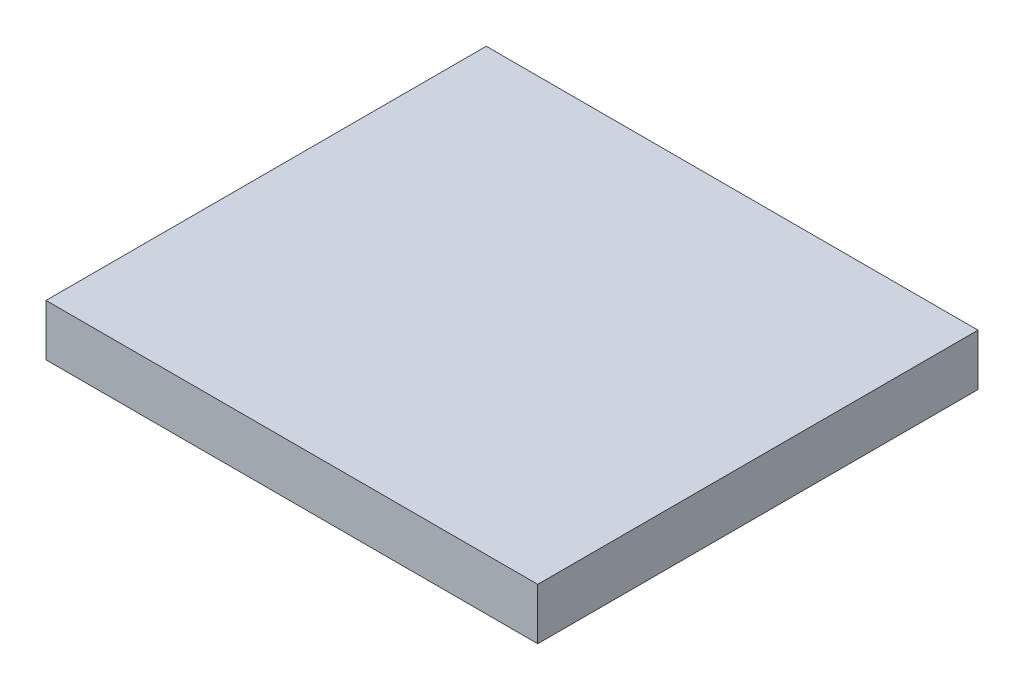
from build123d import *

# Parameters (mm, degrees)
SKETCH1_W      = 92.202
SKETCH1_H      = 82.55
EXTRUDE1_DEPTH = 9.652


with BuildPart() as part:
    # Sketch1 → Extrude1 (new body)
    with BuildSketch(Plane(origin=(0, 0, 0), x_dir=(1, 0, 0), z_dir=(0, 1, 0))):
        with Locations((46.101, 41.275)):
            Rectangle(SKETCH1_W, SKETCH1_H)
    extrude(amount=EXTRUDE1_DEPTH)


solid = part.part
